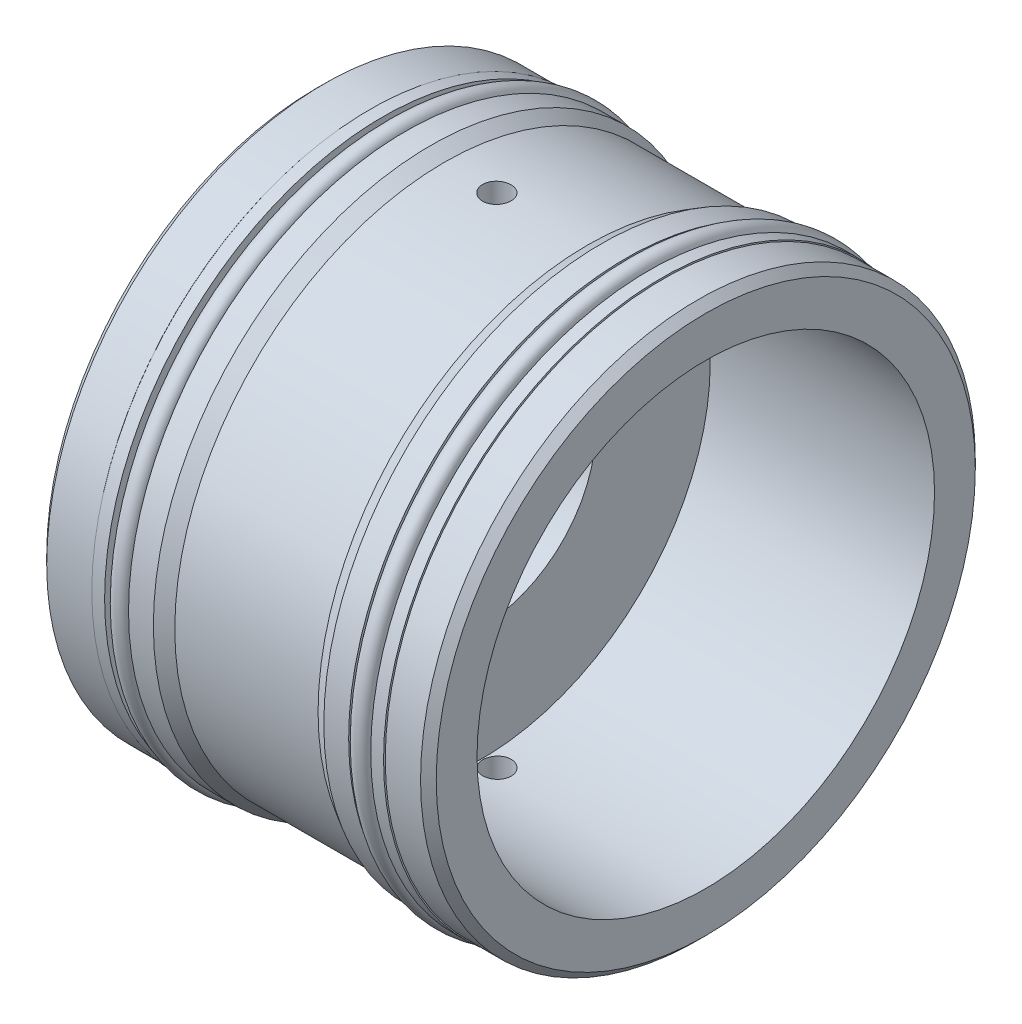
from build123d import *

# Parameters (mm, degrees)
CHAMFER1_SIZE           = 0.762
SKETCH6_R               = 0.889
SKETCH6_W               = 1.2446
SKETCH6_H               = 1.3462
CUT_EXTRUDE1_DEPTH      = 44.115327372
CUT_EXTRUDE1_DEPTH_BACK = 44.115327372
SKETCH7_R               = 1.3843


with BuildPart() as part:
    # Sketch1 → Revolve1 (revolve)
    with BuildSketch(Plane.XY, mode=Mode.PRIVATE) as revolve1_sk:
        Polygon((-18.923, 11.1125), (-18.923, 26.9494), (-13.7668, 26.9494), (-13.7668, 25.6921), (-10.2108, 25.6921), (-10.2108, 26.9494), (-7.7978, 26.9494), (-7.7978, 26.1874), (8.763, 26.1874), (8.763, 26.9494), (11.176, 26.9494), (11.176, 25.6921), (14.732, 25.6921), (14.732, 26.9494), (18.923, 26.9494), (18.923, 22.225), (-2.8702, 22.225), (-2.8702, 11.1125), align=None)
    revolve(revolve1_sk.sketch.rotate(Axis((0, 0, 0), (1, 0, 0)), 90), axis=Axis((0, 0, 0), (1, 0, 0)))

    # Chamfer1
    chamfer1_edges = [part.edges().sort_by_distance(p)[0] for p in [
        (-18.923, 0, -26.9494),
        (18.923, 0, -26.9494),
    ]]
    chamfer(chamfer1_edges, length=CHAMFER1_SIZE)

    # Sketch6 → Revolve3 (revolve)
    with BuildSketch(Plane.XY, mode=Mode.PRIVATE) as revolve3_sk:
        with Locations((-11.176, 26.5049)):
            Circle(SKETCH6_R)
        with Locations((12.1412, 26.5049)):
            Circle(SKETCH6_R)
        with Locations((-13.0683, 26.3652)):
            Rectangle(SKETCH6_W, SKETCH6_H)
        with Locations((14.0335, 26.3652)):
            Rectangle(SKETCH6_W, SKETCH6_H)
    revolve(revolve3_sk.sketch.rotate(Axis((0, 0, 0), (1, 0, 0)), 90), axis=Axis((0, 0, 0), (1, 0, 0)))

    # Sketch7 → Cut-Extrude1 (cut, two sides: drawn at the far end of the back side and taken through both)
    with BuildSketch(Plane(origin=(0, 0, 0), x_dir=(0, 0, -1), z_dir=(0, 1, 0)).offset(-CUT_EXTRUDE1_DEPTH_BACK)):
        with Locations(Location((0, 1.3716, 0), (0, 0, 180))):
            Circle(SKETCH7_R)
    extrude(amount=CUT_EXTRUDE1_DEPTH + CUT_EXTRUDE1_DEPTH_BACK, mode=Mode.SUBTRACT)

    # Sketch8 → Revolve4 (revolve)
    with BuildSketch(Plane.XY, mode=Mode.PRIVATE) as revolve4_sk:
        Polygon((-7.7978, 26.9494), (-7.7978, 26.1874), (-6.477977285, 26.1874), align=None)
        Polygon((7.443177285, 26.1874), (8.763, 26.9494), (8.763, 26.1874), align=None)
    revolve(revolve4_sk.sketch.rotate(Axis((0, 0, 0), (1, 0, 0)), 90), axis=Axis((0, 0, 0), (1, 0, 0)))


solid = part.part
